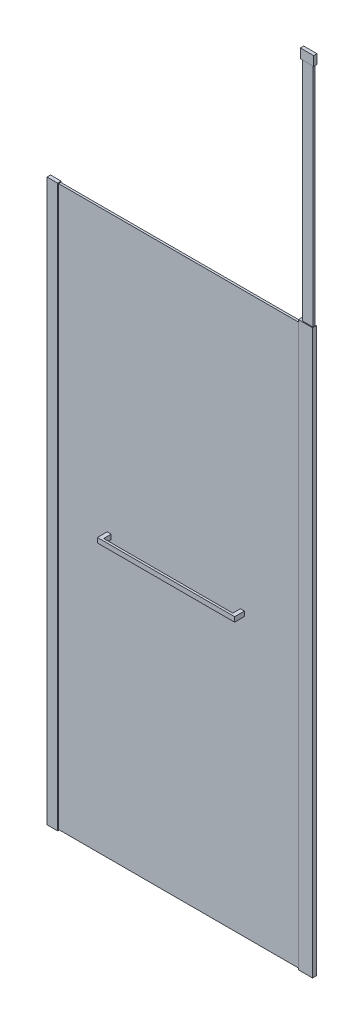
from build123d import *

# Parameters (mm, degrees)
DODANIE_WYCI_GNI_CIE1_START         = 3
DODANIE_WYCI_GNI_CIE1_DEPTH         = 2100
SZKIC2_W                            = 947
SZKIC2_H                            = 8
DODANIE_WYCI_GNI_CIE2_DEPTH         = 2100
DODANIE_WYCI_GNI_CIE3_DEPTH         = 2108
SZKIC4_W                            = 40
SZKIC4_H                            = 13.3
DODANIE_WYCI_GNI_CIE4_DEPTH         = 3
SZKIC5_W                            = 53
SZKIC5_H                            = 14
DODANIE_WYCI_GNI_CIE5_DEPTH         = 3
SZKIC6_W                            = 8.1
SZKIC6_H                            = 7.8
DODANIE_WYCI_GNI_CIE6_DEPTH         = 15
SZKIC7_W                            = 53
SZKIC7_H                            = 14
DODANIE_WYCI_GNI_CIE7_DEPTH         = 3
SZKIC8_W                            = 40
SZKIC8_H                            = 13.3
DODANIE_WYCI_GNI_CIE8_DEPTH         = 3
SZKIC9_W                            = 40
SZKIC9_H                            = 8
DODANIE_WYCI_GNI_CIE9_DEPTH         = 883
DODANIE_WYCI_GNI_CIE10_START        = -32
SZKIC10_W                           = 50
SZKIC10_H                           = 12.5
DODANIE_WYCI_GNI_CIE10_DEPTH        = 35
DODANIE_WYCI_GNI_CIE11_DEPTH        = 36.5
DODANIE_WYCI_GNI_CIE11_DEPTH_BACK   = 18
SZKIC12_W                           = 15
SZKIC12_H                           = 18
DODANIE_WYCI_GNI_CIE11_2_DEPTH      = 36.5
DODANIE_WYCI_GNI_CIE11_2_DEPTH_BACK = 18
SZKIC13_W                           = 8
SZKIC13_H                           = 18
DODANIE_WYCI_GNI_CIE12_DEPTH        = 485


with BuildPart() as part:
    # Szkic1 → Dodanie-wyci_gni_cie1 (new body)
    with BuildSketch(Plane(origin=(0, 0, 0), x_dir=(1, 0, 0), z_dir=(0, 1, 0)).offset(DODANIE_WYCI_GNI_CIE1_START)):
        Polygon((0, 0), (0, 13.3), (40, 13.3), (40, 11.4), (6.5, 11.4), (6.5, 3.4), (40, 3.4), (40, 0), align=None)
    extrude(amount=DODANIE_WYCI_GNI_CIE1_DEPTH)

    # Szkic4 → Dodanie-wyci_gni_cie4 (add)
    with BuildSketch(Plane(origin=(0, 2103, 0), x_dir=(1, 0, 0), z_dir=(0, 1, 0))):
        with Locations((20, 6.65)):
            Rectangle(SZKIC4_W, SZKIC4_H)
    extrude(amount=DODANIE_WYCI_GNI_CIE4_DEPTH)

    # Szkic8 → Dodanie-wyci_gni_cie8 (add)
    with BuildSketch(Plane.XZ.offset(-3)):
        with Locations((20, -6.65)):
            Rectangle(SZKIC8_W, SZKIC8_H)
    extrude(amount=DODANIE_WYCI_GNI_CIE8_DEPTH)


with BuildPart() as body_2:
    # Szkic2 → Dodanie-wyci_gni_cie2 (new body)
    with BuildSketch(Plane.XZ.offset(-3)):
        with Locations((480, -7.4)):
            Rectangle(SZKIC2_W, SZKIC2_H)
    extrude(amount=-DODANIE_WYCI_GNI_CIE2_DEPTH)


with BuildPart() as body_3:
    # Szkic3 → Dodanie-wyci_gni_cie3 (new body)
    with BuildSketch(Plane.XZ.offset(-3)):
        Polygon((943.4, -3.4), (943.4, -0.4), (996.4, -0.4), (996.4, -14.4), (943.4, -14.4), (943.4, -11.4), (953.5, -11.4), (953.5, -3.4), align=None)
    extrude(amount=-DODANIE_WYCI_GNI_CIE3_DEPTH)

    # Szkic5 → Dodanie-wyci_gni_cie5 (add)
    with BuildSketch(Plane(origin=(0, 2111, 0), x_dir=(1, 0, 0), z_dir=(0, 1, 0))):
        with Locations((969.9, 7.4)):
            Rectangle(SZKIC5_W, SZKIC5_H)
    extrude(amount=DODANIE_WYCI_GNI_CIE5_DEPTH)

    # Szkic6 → Dodanie-wyci_gni_cie6 (add)
    with BuildSketch(Plane.ZY.offset(-943.4)):
        with Locations((-7.4, 2107.1)):
            Rectangle(SZKIC6_W, SZKIC6_H)
    extrude(amount=-DODANIE_WYCI_GNI_CIE6_DEPTH)

    # Szkic7 → Dodanie-wyci_gni_cie7 (add)
    with BuildSketch(Plane.XZ.offset(-3)):
        with Locations((969.9, -7.4)):
            Rectangle(SZKIC7_W, SZKIC7_H)
    extrude(amount=DODANIE_WYCI_GNI_CIE7_DEPTH)


with BuildPart() as body_4:
    # Szkic9 → Dodanie-wyci_gni_cie9 (new body)
    with BuildSketch(Plane(origin=(0, 2114, 2099.6), x_dir=(-1, 0, 0), z_dir=(0, -1, 0))):
        with Locations((-974.9, 2107)):
            Rectangle(SZKIC9_W, SZKIC9_H)
    extrude(amount=-DODANIE_WYCI_GNI_CIE9_DEPTH)

    # Szkic10 → Dodanie-wyci_gni_cie10 (add)
    with BuildSketch(Plane(origin=(0, 2997, 0), x_dir=(-1, 0, 0), z_dir=(0, 1, 0)).offset(DODANIE_WYCI_GNI_CIE10_START)):
        with Locations((-974.9, -7.4)):
            Rectangle(SZKIC10_W, SZKIC10_H)
    extrude(amount=DODANIE_WYCI_GNI_CIE10_DEPTH)


with BuildPart() as body_5:
    # Szkic12 → Dodanie-wyci_gni_cie11 (new, two sides: drawn at the far end of the back side and taken through both)
    with BuildSketch(Plane.XY.offset(-3.4).offset(-DODANIE_WYCI_GNI_CIE11_DEPTH_BACK)):
        with Locations((230, 1053)):
            Rectangle(SZKIC12_W, SZKIC12_H)
    extrude(amount=DODANIE_WYCI_GNI_CIE11_DEPTH + DODANIE_WYCI_GNI_CIE11_DEPTH_BACK)



with BuildPart() as body_6:
    # Szkic12 → Dodanie-wyci_gni_cie11 2 (new, two sides: drawn at the far end of the back side and taken through both)
    with BuildSketch(Plane.XY.offset(-3.4).offset(-DODANIE_WYCI_GNI_CIE11_2_DEPTH_BACK)):
        with Locations((730, 1053)):
            Rectangle(SZKIC12_W, SZKIC12_H)
    extrude(amount=DODANIE_WYCI_GNI_CIE11_2_DEPTH + DODANIE_WYCI_GNI_CIE11_2_DEPTH_BACK)


with BuildPart() as body_5_1:
    add(body_5.part)

    add(body_6.part)  # Dodanie-wyci_gni_cie12 merges body 6
    # Szkic13 → Dodanie-wyci_gni_cie12 (add)
    with BuildSketch(Plane(origin=(237.5, 0, 0), x_dir=(0, 0, -1), z_dir=(1, 0, 0))):
        with Locations((-29.1, 1053)):
            Rectangle(SZKIC13_W, SZKIC13_H)
    extrude(amount=DODANIE_WYCI_GNI_CIE12_DEPTH)


solid = Compound([part.part, body_2.part, body_3.part, body_4.part, body_5_1.part])
